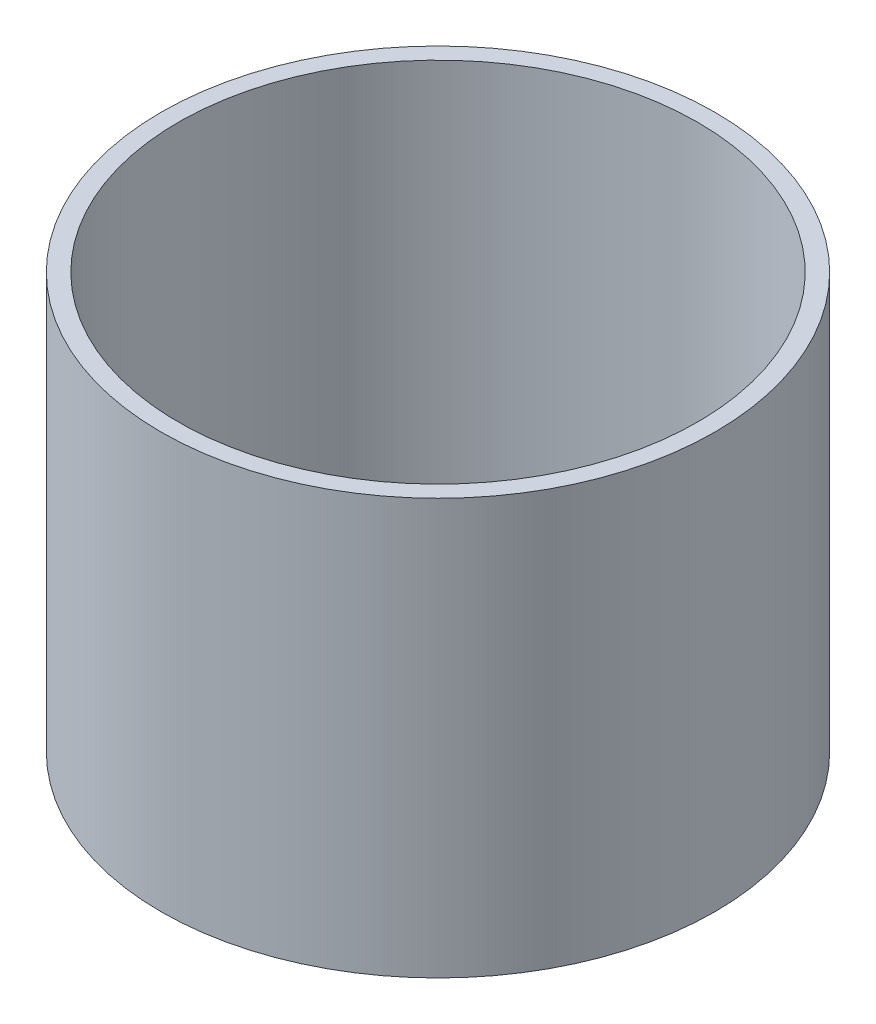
from build123d import *

# Parameters (mm, degrees)
ESQUISSE1_W = 2.5
ESQUISSE1_H = 60


with BuildPart() as part:
    # Esquisse1 → R_volution1 (revolve)
    with BuildSketch(Plane.XY, mode=Mode.PRIVATE) as r_volution1_sk:
        with Locations((-38.75, 30)):
            Rectangle(ESQUISSE1_W, ESQUISSE1_H)
    revolve(r_volution1_sk.sketch.rotate(Axis((0, 0, 0), (0, 1, 0)), 270), axis=Axis((0, 0, 0), (0, 1, 0)))


solid = part.part
